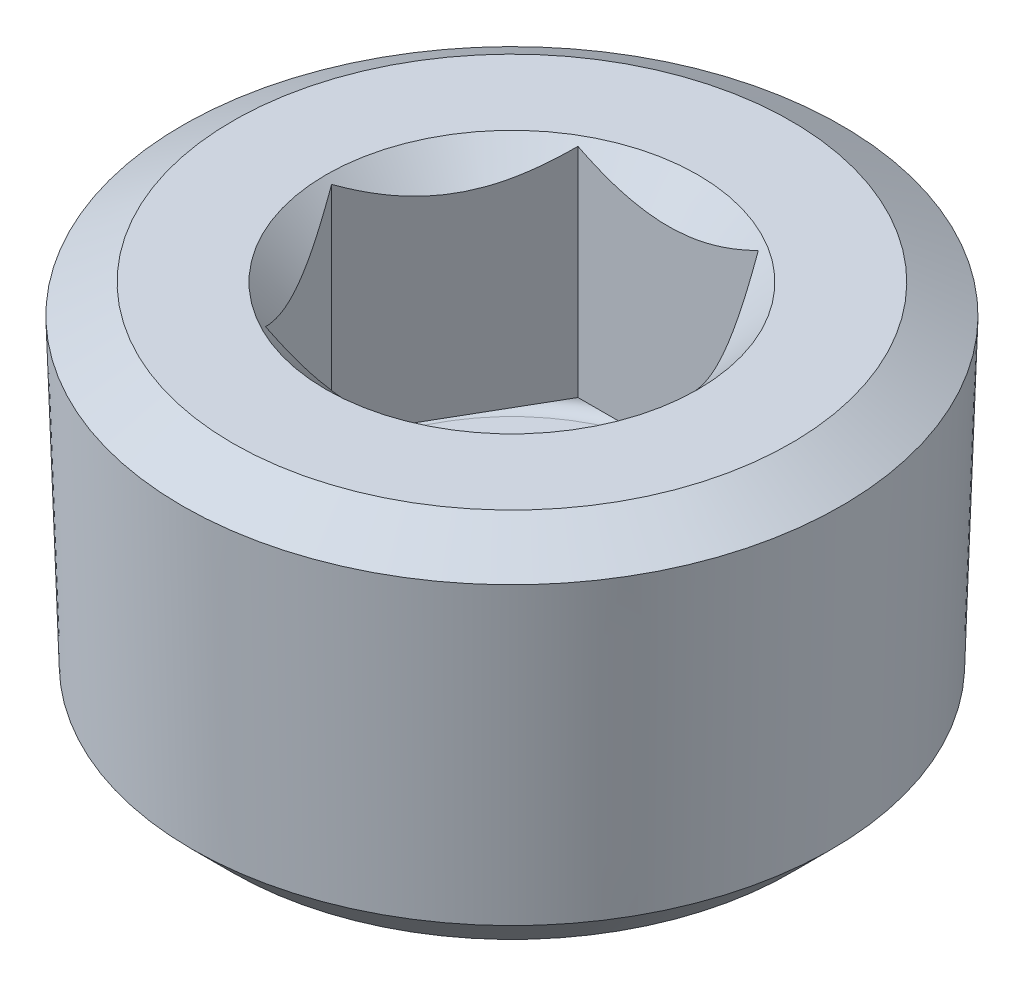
ISO-10303-21;
HEADER;
FILE_DESCRIPTION(('STEP AP214'),'2;1');
FILE_NAME('part.step','',(''),(''),'','','');
FILE_SCHEMA(('AUTOMOTIVE_DESIGN { 1 0 10303 214 1 1 1 1 }'));
ENDSEC;
DATA;
#1=APPLICATION_CONTEXT('core data for automotive mechanical design processes');
#2=APPLICATION_PROTOCOL_DEFINITION('international standard','automotive_design',2000,#1);
#3=PRODUCT_CONTEXT('',#1,'mechanical');
#4=PRODUCT('Part','Part','',(#3));
#5=PRODUCT_RELATED_PRODUCT_CATEGORY('part','',(#4));
#6=PRODUCT_DEFINITION_FORMATION('','',#4);
#7=PRODUCT_DEFINITION_CONTEXT('part definition',#1,'design');
#8=PRODUCT_DEFINITION('design','',#6,#7);
#9=PRODUCT_DEFINITION_SHAPE('','',#8);
#10=(LENGTH_UNIT() NAMED_UNIT(*) SI_UNIT(.MILLI.,.METRE.));
#11=(NAMED_UNIT(*) PLANE_ANGLE_UNIT() SI_UNIT($,.RADIAN.));
#12=(NAMED_UNIT(*) SI_UNIT($,.STERADIAN.) SOLID_ANGLE_UNIT());
#13=UNCERTAINTY_MEASURE_WITH_UNIT(LENGTH_MEASURE(1.E-05),#10,'distance_accuracy_value','');
#14=(GEOMETRIC_REPRESENTATION_CONTEXT(3) GLOBAL_UNCERTAINTY_ASSIGNED_CONTEXT((#13)) GLOBAL_UNIT_ASSIGNED_CONTEXT((#10,
#11,#12)) REPRESENTATION_CONTEXT('',''));
#15=CARTESIAN_POINT('',(0.,0.,0.));
#16=DIRECTION('',(0.,0.,1.));
#17=DIRECTION('',(1.,0.,0.));
#18=AXIS2_PLACEMENT_3D('',#15,#16,#17);
#19=CARTESIAN_POINT('',(0.,0.,0.));
#20=DIRECTION('',(0.,1.,0.));
#21=DIRECTION('',(0.,0.,1.));
#22=AXIS2_PLACEMENT_3D('',#19,#20,#21);
#23=PLANE('',#22);
#24=CARTESIAN_POINT('',(0.,0.,0.));
#25=DIRECTION('',(0.,1.,0.));
#26=DIRECTION('',(0.,0.,1.));
#27=AXIS2_PLACEMENT_3D('',#24,#25,#26);
#28=CIRCLE('',#27,9.525);
#29=CARTESIAN_POINT('',(0.,0.,9.525));
#30=VERTEX_POINT('',#29);
#31=EDGE_CURVE('E210',#30,#30,#28,.T.);
#32=ORIENTED_EDGE('',*,*,#31,.F.);
#33=EDGE_LOOP('',(#32));
#34=FACE_BOUND('',#33,.T.);
#35=CARTESIAN_POINT('',(0.,0.,0.));
#36=DIRECTION('',(0.,1.,0.));
#37=DIRECTION('',(0.,0.,1.));
#38=AXIS2_PLACEMENT_3D('',#35,#36,#37);
#39=CIRCLE('',#38,14.3024233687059);
#40=CARTESIAN_POINT('',(0.,0.,14.3024233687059));
#41=VERTEX_POINT('',#40);
#42=EDGE_CURVE('E96',#41,#41,#39,.T.);
#43=ORIENTED_EDGE('',*,*,#42,.T.);
#44=EDGE_LOOP('',(#43));
#45=FACE_BOUND('',#44,.T.);
#46=ADVANCED_FACE('F34',(#34,#45),#23,.T.);
#47=CARTESIAN_POINT('',(0.,0.,0.));
#48=DIRECTION('',(0.,-1.,0.));
#49=DIRECTION('',(0.,0.,-1.));
#50=AXIS2_PLACEMENT_3D('',#47,#48,#49);
#51=CONICAL_SURFACE('',#50,14.3024233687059,1.0471975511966);
#52=CARTESIAN_POINT('',(0.,-1.48966435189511,0.));
#53=DIRECTION('',(0.,1.,0.));
#54=DIRECTION('',(0.,0.,1.));
#55=AXIS2_PLACEMENT_3D('',#52,#53,#54);
#56=CIRCLE('',#55,16.8825977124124);
#57=CARTESIAN_POINT('',(0.,-1.48966435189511,16.8825977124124));
#58=VERTEX_POINT('',#57);
#59=EDGE_CURVE('E214',#58,#58,#56,.T.);
#60=ORIENTED_EDGE('',*,*,#59,.T.);
#61=EDGE_LOOP('',(#60));
#62=FACE_BOUND('',#61,.T.);
#63=ORIENTED_EDGE('',*,*,#42,.F.);
#64=EDGE_LOOP('',(#63));
#65=FACE_BOUND('',#64,.T.);
#66=ADVANCED_FACE('F200',(#62,#65),#51,.T.);
#67=CARTESIAN_POINT('',(0.,-1.48966435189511,0.));
#68=DIRECTION('',(0.,1.,0.));
#69=DIRECTION('',(0.,0.,1.));
#70=AXIS2_PLACEMENT_3D('',#67,#68,#69);
#71=CONICAL_SURFACE('',#70,16.8825977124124,0.0312064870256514);
#72=CARTESIAN_POINT('',(0.,-16.9525238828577,0.));
#73=DIRECTION('',(0.,1.,0.));
#74=DIRECTION('',(0.,0.,1.));
#75=AXIS2_PLACEMENT_3D('',#72,#73,#74);
#76=CIRCLE('',#75,16.3998994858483);
#77=CARTESIAN_POINT('',(0.,-16.9525238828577,16.3998994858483));
#78=VERTEX_POINT('',#77);
#79=EDGE_CURVE('E217',#78,#78,#76,.T.);
#80=ORIENTED_EDGE('',*,*,#79,.T.);
#81=EDGE_LOOP('',(#80));
#82=FACE_BOUND('',#81,.T.);
#83=ORIENTED_EDGE('',*,*,#59,.F.);
#84=EDGE_LOOP('',(#83));
#85=FACE_BOUND('',#84,.T.);
#86=ADVANCED_FACE('F205',(#82,#85),#71,.T.);
#87=CARTESIAN_POINT('',(0.,-16.9525238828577,0.));
#88=DIRECTION('',(0.,1.,0.));
#89=DIRECTION('',(0.,0.,1.));
#90=AXIS2_PLACEMENT_3D('',#87,#88,#89);
#91=CONICAL_SURFACE('',#90,16.3998994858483,0.785398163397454);
#92=CARTESIAN_POINT('',(0.,-19.05,0.));
#93=DIRECTION('',(0.,1.,0.));
#94=DIRECTION('',(0.,0.,1.));
#95=AXIS2_PLACEMENT_3D('',#92,#93,#94);
#96=CIRCLE('',#95,14.3024233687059);
#97=CARTESIAN_POINT('',(0.,-19.05,14.3024233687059));
#98=VERTEX_POINT('',#97);
#99=EDGE_CURVE('E222',#98,#98,#96,.T.);
#100=ORIENTED_EDGE('',*,*,#99,.T.);
#101=EDGE_LOOP('',(#100));
#102=FACE_BOUND('',#101,.T.);
#103=ORIENTED_EDGE('',*,*,#79,.F.);
#104=EDGE_LOOP('',(#103));
#105=FACE_BOUND('',#104,.T.);
#106=ADVANCED_FACE('F305',(#102,#105),#91,.T.);
#107=CARTESIAN_POINT('',(-14.3024233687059,-19.05,0.));
#108=DIRECTION('',(0.,-1.,0.));
#109=DIRECTION('',(0.,0.,-1.));
#110=AXIS2_PLACEMENT_3D('',#107,#108,#109);
#111=PLANE('',#110);
#112=ORIENTED_EDGE('',*,*,#99,.F.);
#113=EDGE_LOOP('',(#112));
#114=FACE_BOUND('',#113,.T.);
#115=ADVANCED_FACE('F149',(#114),#111,.T.);
#116=CARTESIAN_POINT('',(0.,0.,0.));
#117=DIRECTION('',(0.,1.,0.));
#118=DIRECTION('',(0.,0.,1.));
#119=AXIS2_PLACEMENT_3D('',#116,#117,#118);
#120=CONICAL_SURFACE('',#119,9.525,0.785398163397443);
#121=CARTESIAN_POINT('',(-9.75620633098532,3.09243091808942,8.001));
#122=CARTESIAN_POINT('',(-9.52094099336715,2.91055682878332,8.001));
#123=CARTESIAN_POINT('',(-9.28442126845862,2.73028010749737,8.001));
#124=CARTESIAN_POINT('',(-8.80835565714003,2.37365499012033,8.001));
#125=CARTESIAN_POINT('',(-8.56880907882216,2.19730751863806,8.001));
#126=CARTESIAN_POINT('',(-8.0844234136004,1.8480200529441,8.001));
#127=CARTESIAN_POINT('',(-7.83955777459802,1.67511676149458,8.001));
#128=CARTESIAN_POINT('',(-7.34577433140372,1.33521676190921,8.001));
#129=CARTESIAN_POINT('',(-7.0968568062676,1.16821964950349,8.001));
#130=CARTESIAN_POINT('',(-6.57791291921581,0.830846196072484,8.001));
#131=CARTESIAN_POINT('',(-6.30756757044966,0.660958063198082,8.001));
#132=CARTESIAN_POINT('',(-5.76052121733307,0.331566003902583,8.001));
#133=CARTESIAN_POINT('',(-5.4838191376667,0.172063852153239,8.001));
#134=CARTESIAN_POINT('',(-4.92395672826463,-0.133171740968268,8.001));
#135=CARTESIAN_POINT('',(-4.64081858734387,-0.278945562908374,8.001));
#136=CARTESIAN_POINT('',(-4.06646640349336,-0.553458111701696,8.001));
#137=CARTESIAN_POINT('',(-3.77525629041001,-0.682204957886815,8.001));
#138=CARTESIAN_POINT('',(-3.21459014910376,-0.905803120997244,8.001));
#139=CARTESIAN_POINT('',(-2.94599103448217,-1.00278136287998,8.001));
#140=CARTESIAN_POINT('',(-2.40185059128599,-1.17524738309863,8.001));
#141=CARTESIAN_POINT('',(-2.12630883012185,-1.25073381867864,8.001));
#142=CARTESIAN_POINT('',(-1.57478797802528,-1.37483041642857,8.001));
#143=CARTESIAN_POINT('',(-1.29892235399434,-1.42393631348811,8.001));
#144=CARTESIAN_POINT('',(-0.743636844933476,-1.49423018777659,8.001));
#145=CARTESIAN_POINT('',(-0.46421774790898,-1.51542424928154,8.001));
#146=CARTESIAN_POINT('',(0.0824654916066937,-1.52802781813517,8.001));
#147=CARTESIAN_POINT('',(0.349699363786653,-1.5207587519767,8.001));
#148=CARTESIAN_POINT('',(0.88213316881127,-1.47989810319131,8.001));
#149=CARTESIAN_POINT('',(1.14733291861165,-1.44630417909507,8.001));
#150=CARTESIAN_POINT('',(1.67827793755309,-1.35414026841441,8.001));
#151=CARTESIAN_POINT('',(1.94394456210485,-1.29512495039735,8.001));
#152=CARTESIAN_POINT('',(2.46940811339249,-1.15542669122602,8.001));
#153=CARTESIAN_POINT('',(2.72920532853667,-1.07474481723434,8.001));
#154=CARTESIAN_POINT('',(3.25501235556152,-0.890913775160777,8.001));
#155=CARTESIAN_POINT('',(3.52070069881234,-0.786855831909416,8.001));
#156=CARTESIAN_POINT('',(4.04525678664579,-0.562643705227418,8.001));
#157=CARTESIAN_POINT('',(4.30412141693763,-0.442482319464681,8.001));
#158=CARTESIAN_POINT('',(4.81624343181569,-0.188911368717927,8.001));
#159=CARTESIAN_POINT('',(5.06948054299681,-0.0554611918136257,8.001));
#160=CARTESIAN_POINT('',(5.57015704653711,0.221753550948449,8.001));
#161=CARTESIAN_POINT('',(5.81759731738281,0.365516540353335,8.001));
#162=CARTESIAN_POINT('',(6.29535628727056,0.654051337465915,8.001));
#163=CARTESIAN_POINT('',(6.52591752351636,0.798423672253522,8.001));
#164=CARTESIAN_POINT('',(6.98307831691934,1.09332822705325,8.001));
#165=CARTESIAN_POINT('',(7.20967757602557,1.24386090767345,8.001));
#166=CARTESIAN_POINT('',(7.65761461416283,1.5487666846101,8.001));
#167=CARTESIAN_POINT('',(7.87897999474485,1.7030993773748,8.001));
#168=CARTESIAN_POINT('',(8.31867170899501,2.01591299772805,8.001));
#169=CARTESIAN_POINT('',(8.53699886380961,2.17439276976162,8.001));
#170=CARTESIAN_POINT('',(8.75405107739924,2.33457045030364,8.001));
#171=B_SPLINE_CURVE_WITH_KNOTS('',3,(#121,#122,#123,#124,#125,#126,#127,#128,#129,#130,#131,
#132,#133,#134,#135,#136,#137,#138,#139,#140,#141,#142,#143,#144,#145,#146,#147,#148,#149,#150,
#151,#152,#153,#154,#155,#156,#157,#158,#159,#160,#161,#162,#163,#164,#165,#166,#167,#168,#169,
#170),.UNSPECIFIED.,.F.,.F.,(4,2,2,2,2,2,2,2,2,2,2,2,2,2,2,2,2,2,2,2,2,2,2,2,4),(0.,
0.892121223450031,1.784450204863,2.68365151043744,3.58279114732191,4.54048731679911,
5.4983467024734,6.45329436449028,7.40778500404,8.26376032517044,9.11978911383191,
9.95911277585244,10.7982534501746,11.5989086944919,12.3996351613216,13.2149987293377,
14.030322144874,14.885685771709,15.7414332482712,16.5998812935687,17.4581983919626,
18.274182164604,19.0902270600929,19.8997375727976,20.7090248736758),.UNSPECIFIED.);
#172=CARTESIAN_POINT('',(4.6193795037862,-0.286240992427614,8.001));
#173=VERTEX_POINT('',#172);
#174=CARTESIAN_POINT('',(-4.61937950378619,-0.286240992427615,8.001));
#175=VERTEX_POINT('',#174);
#176=EDGE_CURVE('E48',#173,#175,#171,.F.);
#177=ORIENTED_EDGE('',*,*,#176,.T.);
#178=CARTESIAN_POINT('',(-4.61926403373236,-0.28612552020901,8.0012));
#179=CARTESIAN_POINT('',(-4.69869011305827,-0.365542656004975,7.86362999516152));
#180=CARTESIAN_POINT('',(-4.77872669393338,-0.442522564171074,7.72500257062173));
#181=CARTESIAN_POINT('',(-4.94014062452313,-0.590866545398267,7.44542544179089));
#182=CARTESIAN_POINT('',(-5.02151867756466,-0.662227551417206,7.30447451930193));
#183=CARTESIAN_POINT('',(-5.2686006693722,-0.867378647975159,6.87651595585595));
#184=CARTESIAN_POINT('',(-5.43639624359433,-0.991361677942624,6.58588549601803));
#185=CARTESIAN_POINT('',(-5.77476940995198,-1.20367390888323,5.99980597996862));
#186=CARTESIAN_POINT('',(-5.94526052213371,-1.29253797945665,5.70450671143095));
#187=CARTESIAN_POINT('',(-6.2038000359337,-1.39533175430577,5.25670313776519));
#188=CARTESIAN_POINT('',(-6.29036050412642,-1.42449887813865,5.10677600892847));
#189=CARTESIAN_POINT('',(-6.46421433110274,-1.47200567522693,4.80565234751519));
#190=CARTESIAN_POINT('',(-6.55150757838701,-1.49034696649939,4.65445600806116));
#191=CARTESIAN_POINT('',(-6.7642309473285,-1.52109895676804,4.28600832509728));
#192=CARTESIAN_POINT('',(-6.88989027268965,-1.52755109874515,4.06835998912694));
#193=CARTESIAN_POINT('',(-7.14098242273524,-1.51672016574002,3.63345562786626));
#194=CARTESIAN_POINT('',(-7.26641515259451,-1.49942877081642,3.41619976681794));
#195=CARTESIAN_POINT('',(-7.51609803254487,-1.44213002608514,2.98373633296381));
#196=CARTESIAN_POINT('',(-7.64034670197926,-1.40209727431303,2.76853132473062));
#197=CARTESIAN_POINT('',(-7.88670850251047,-1.30149224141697,2.34182016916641));
#198=CARTESIAN_POINT('',(-8.00882179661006,-1.24092153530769,2.13031373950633));
#199=CARTESIAN_POINT('',(-8.22559130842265,-1.11631110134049,1.75485793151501));
#200=CARTESIAN_POINT('',(-8.32072758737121,-1.05554902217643,1.59007706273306));
#201=CARTESIAN_POINT('',(-8.5092923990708,-0.924233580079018,1.26347322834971));
#202=CARTESIAN_POINT('',(-8.60272088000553,-0.853679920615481,1.10165035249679));
#203=CARTESIAN_POINT('',(-8.78757582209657,-0.704362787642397,0.781472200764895));
#204=CARTESIAN_POINT('',(-8.87900754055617,-0.62562513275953,0.623107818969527));
#205=CARTESIAN_POINT('',(-9.06017798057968,-0.460973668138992,0.309311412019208));
#206=CARTESIAN_POINT('',(-9.14991769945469,-0.375064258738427,0.153877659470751));
#207=CARTESIAN_POINT('',(-9.23887447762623,-0.28612552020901,-0.000199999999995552));
#208=B_SPLINE_CURVE_WITH_KNOTS('',3,(#178,#179,#180,#181,#182,#183,#184,#185,#186,#187,#188,
#189,#190,#191,#192,#193,#194,#195,#196,#197,#198,#199,#200,#201,#202,#203,#204,#205,#206,#207),
.UNSPECIFIED.,.F.,.F.,(4,2,2,2,2,2,2,2,2,2,2,2,2,2,4),(0.,0.532763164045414,1.06581514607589,
2.13767380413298,3.1925129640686,3.71889809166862,4.24520452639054,4.99823705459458,
5.75153351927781,6.5056730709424,7.25975480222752,7.8586907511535,8.45764484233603,
9.05476364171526,9.6515187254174),.UNSPECIFIED.);
#209=CARTESIAN_POINT('',(-9.23875900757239,-0.286240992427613,0.));
#210=VERTEX_POINT('',#209);
#211=EDGE_CURVE('E102',#175,#210,#208,.T.);
#212=ORIENTED_EDGE('',*,*,#211,.T.);
#213=CARTESIAN_POINT('',(-9.23887447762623,-0.28612552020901,0.000200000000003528));
#214=CARTESIAN_POINT('',(-9.15944839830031,-0.365542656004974,-0.137370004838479));
#215=CARTESIAN_POINT('',(-9.0794118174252,-0.442522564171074,-0.275997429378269));
#216=CARTESIAN_POINT('',(-8.91799788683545,-0.590866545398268,-0.555574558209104));
#217=CARTESIAN_POINT('',(-8.83661983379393,-0.662227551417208,-0.696525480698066));
#218=CARTESIAN_POINT('',(-8.58953784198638,-0.867378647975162,-1.12448404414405));
#219=CARTESIAN_POINT('',(-8.42174226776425,-0.991361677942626,-1.41511450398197));
#220=CARTESIAN_POINT('',(-8.0833691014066,-1.20367390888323,-2.00119402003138));
#221=CARTESIAN_POINT('',(-7.91287798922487,-1.29253797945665,-2.29649328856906));
#222=CARTESIAN_POINT('',(-7.65433847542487,-1.39533175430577,-2.74429686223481));
#223=CARTESIAN_POINT('',(-7.56777800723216,-1.42449887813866,-2.89422399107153));
#224=CARTESIAN_POINT('',(-7.39392418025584,-1.47200567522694,-3.19534765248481));
#225=CARTESIAN_POINT('',(-7.30663093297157,-1.4903469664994,-3.34654399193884));
#226=CARTESIAN_POINT('',(-7.09390756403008,-1.52109895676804,-3.71499167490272));
#227=CARTESIAN_POINT('',(-6.96824823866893,-1.52755109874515,-3.93264001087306));
#228=CARTESIAN_POINT('',(-6.71715608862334,-1.51672016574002,-4.36754437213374));
#229=CARTESIAN_POINT('',(-6.59172335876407,-1.49942877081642,-4.58480023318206));
#230=CARTESIAN_POINT('',(-6.34204047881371,-1.44213002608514,-5.01726366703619));
#231=CARTESIAN_POINT('',(-6.21779180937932,-1.40209727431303,-5.23246867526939));
#232=CARTESIAN_POINT('',(-5.97143000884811,-1.30149224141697,-5.6591798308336));
#233=CARTESIAN_POINT('',(-5.84931671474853,-1.24092153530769,-5.87068626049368));
#234=CARTESIAN_POINT('',(-5.63254720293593,-1.11631110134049,-6.246142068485));
#235=CARTESIAN_POINT('',(-5.53741092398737,-1.05554902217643,-6.41092293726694));
#236=CARTESIAN_POINT('',(-5.34884611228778,-0.924233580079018,-6.73752677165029));
#237=CARTESIAN_POINT('',(-5.25541763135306,-0.853679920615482,-6.89934964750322));
#238=CARTESIAN_POINT('',(-5.07056268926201,-0.704362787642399,-7.21952779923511));
#239=CARTESIAN_POINT('',(-4.97913097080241,-0.625625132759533,-7.37789218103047));
#240=CARTESIAN_POINT('',(-4.7979605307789,-0.460973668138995,-7.69168858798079));
#241=CARTESIAN_POINT('',(-4.7082208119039,-0.37506425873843,-7.84712234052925));
#242=CARTESIAN_POINT('',(-4.61926403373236,-0.286125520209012,-8.0012));
#243=B_SPLINE_CURVE_WITH_KNOTS('',3,(#213,#214,#215,#216,#217,#218,#219,#220,#221,#222,#223,
#224,#225,#226,#227,#228,#229,#230,#231,#232,#233,#234,#235,#236,#237,#238,#239,#240,#241,#242),
.UNSPECIFIED.,.F.,.F.,(4,2,2,2,2,2,2,2,2,2,2,2,2,2,4),(0.,0.532763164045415,1.06581514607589,
2.13767380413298,3.19251296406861,3.71889809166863,4.24520452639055,4.99823705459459,
5.75153351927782,6.50567307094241,7.25975480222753,7.85869075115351,8.45764484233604,
9.05476364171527,9.65151872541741),.UNSPECIFIED.);
#244=CARTESIAN_POINT('',(-4.6193795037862,-0.286240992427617,-8.00099999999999));
#245=VERTEX_POINT('',#244);
#246=EDGE_CURVE('E172',#210,#245,#243,.T.);
#247=ORIENTED_EDGE('',*,*,#246,.T.);
#248=CARTESIAN_POINT('',(-9.75620633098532,3.09243091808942,-8.00099999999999));
#249=CARTESIAN_POINT('',(-9.52094099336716,2.91055682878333,-8.00099999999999));
#250=CARTESIAN_POINT('',(-9.28442126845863,2.73028010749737,-8.00099999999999));
#251=CARTESIAN_POINT('',(-8.80835565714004,2.37365499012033,-8.00099999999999));
#252=CARTESIAN_POINT('',(-8.56880907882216,2.19730751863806,-8.00099999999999));
#253=CARTESIAN_POINT('',(-8.08442341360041,1.8480200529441,-8.00099999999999));
#254=CARTESIAN_POINT('',(-7.83955777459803,1.67511676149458,-8.00099999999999));
#255=CARTESIAN_POINT('',(-7.34577433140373,1.33521676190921,-8.00099999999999));
#256=CARTESIAN_POINT('',(-7.0968568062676,1.16821964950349,-8.00099999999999));
#257=CARTESIAN_POINT('',(-6.57791291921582,0.830846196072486,-8.00099999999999));
#258=CARTESIAN_POINT('',(-6.30756757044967,0.660958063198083,-8.00099999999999));
#259=CARTESIAN_POINT('',(-5.76052121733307,0.331566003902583,-8.00099999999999));
#260=CARTESIAN_POINT('',(-5.4838191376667,0.172063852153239,-8.00099999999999));
#261=CARTESIAN_POINT('',(-4.92395672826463,-0.133171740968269,-8.00099999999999));
#262=CARTESIAN_POINT('',(-4.64081858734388,-0.278945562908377,-8.00099999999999));
#263=CARTESIAN_POINT('',(-4.06646640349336,-0.5534581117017,-8.00099999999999));
#264=CARTESIAN_POINT('',(-3.77525629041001,-0.682204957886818,-8.00099999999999));
#265=CARTESIAN_POINT('',(-3.21459014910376,-0.905803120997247,-8.00099999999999));
#266=CARTESIAN_POINT('',(-2.94599103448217,-1.00278136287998,-8.00099999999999));
#267=CARTESIAN_POINT('',(-2.40185059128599,-1.17524738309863,-8.00099999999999));
#268=CARTESIAN_POINT('',(-2.12630883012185,-1.25073381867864,-8.00099999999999));
#269=CARTESIAN_POINT('',(-1.57478797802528,-1.37483041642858,-8.00099999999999));
#270=CARTESIAN_POINT('',(-1.29892235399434,-1.42393631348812,-8.00099999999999));
#271=CARTESIAN_POINT('',(-0.743636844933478,-1.49423018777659,-8.00099999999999));
#272=CARTESIAN_POINT('',(-0.464217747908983,-1.51542424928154,-8.00099999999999));
#273=CARTESIAN_POINT('',(0.0824654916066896,-1.52802781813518,-8.00099999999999));
#274=CARTESIAN_POINT('',(0.349699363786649,-1.5207587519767,-8.00099999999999));
#275=CARTESIAN_POINT('',(0.882133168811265,-1.47989810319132,-8.00099999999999));
#276=CARTESIAN_POINT('',(1.14733291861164,-1.44630417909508,-8.00099999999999));
#277=CARTESIAN_POINT('',(1.67827793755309,-1.35414026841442,-8.00099999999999));
#278=CARTESIAN_POINT('',(1.94394456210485,-1.29512495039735,-8.00099999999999));
#279=CARTESIAN_POINT('',(2.46940811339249,-1.15542669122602,-8.00099999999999));
#280=CARTESIAN_POINT('',(2.72920532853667,-1.07474481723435,-8.00099999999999));
#281=CARTESIAN_POINT('',(3.25501235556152,-0.89091377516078,-8.00099999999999));
#282=CARTESIAN_POINT('',(3.52070069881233,-0.78685583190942,-8.00099999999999));
#283=CARTESIAN_POINT('',(4.04525678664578,-0.562643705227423,-8.00099999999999));
#284=CARTESIAN_POINT('',(4.30412141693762,-0.442482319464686,-8.00099999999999));
#285=CARTESIAN_POINT('',(4.81624343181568,-0.188911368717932,-8.00099999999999));
#286=CARTESIAN_POINT('',(5.06948054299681,-0.0554611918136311,-8.00099999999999));
#287=CARTESIAN_POINT('',(5.5701570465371,0.221753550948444,-8.00099999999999));
#288=CARTESIAN_POINT('',(5.81759731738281,0.365516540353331,-8.00099999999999));
#289=CARTESIAN_POINT('',(6.29535628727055,0.654051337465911,-8.00099999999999));
#290=CARTESIAN_POINT('',(6.52591752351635,0.798423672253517,-8.00099999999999));
#291=CARTESIAN_POINT('',(6.98307831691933,1.09332822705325,-8.00099999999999));
#292=CARTESIAN_POINT('',(7.20967757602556,1.24386090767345,-8.00099999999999));
#293=CARTESIAN_POINT('',(7.65761461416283,1.5487666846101,-8.00099999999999));
#294=CARTESIAN_POINT('',(7.87897999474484,1.70309937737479,-8.00099999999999));
#295=CARTESIAN_POINT('',(8.31867170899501,2.01591299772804,-8.00099999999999));
#296=CARTESIAN_POINT('',(8.5369988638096,2.17439276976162,-8.00099999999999));
#297=CARTESIAN_POINT('',(8.75405107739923,2.33457045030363,-8.00099999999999));
#298=B_SPLINE_CURVE_WITH_KNOTS('',3,(#248,#249,#250,#251,#252,#253,#254,#255,#256,#257,#258,
#259,#260,#261,#262,#263,#264,#265,#266,#267,#268,#269,#270,#271,#272,#273,#274,#275,#276,#277,
#278,#279,#280,#281,#282,#283,#284,#285,#286,#287,#288,#289,#290,#291,#292,#293,#294,#295,#296,
#297),.UNSPECIFIED.,.F.,.F.,(4,2,2,2,2,2,2,2,2,2,2,2,2,2,2,2,2,2,2,2,2,2,2,2,4),(0.,
0.892121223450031,1.784450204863,2.68365151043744,3.58279114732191,4.54048731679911,
5.49834670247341,6.45329436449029,7.40778500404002,8.26376032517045,9.11978911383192,
9.95911277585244,10.7982534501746,11.5989086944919,12.3996351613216,13.2149987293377,
14.030322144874,14.885685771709,15.7414332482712,16.5998812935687,17.4581983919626,
18.274182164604,19.0902270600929,19.8997375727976,20.7090248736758),.UNSPECIFIED.);
#299=CARTESIAN_POINT('',(4.61937950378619,-0.286240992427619,-8.00099999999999));
#300=VERTEX_POINT('',#299);
#301=EDGE_CURVE('E165',#245,#300,#298,.T.);
#302=ORIENTED_EDGE('',*,*,#301,.T.);
#303=CARTESIAN_POINT('',(4.61926403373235,-0.286125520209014,-8.0012));
#304=CARTESIAN_POINT('',(4.69869011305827,-0.365542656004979,-7.86362999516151));
#305=CARTESIAN_POINT('',(4.77872669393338,-0.442522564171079,-7.72500257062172));
#306=CARTESIAN_POINT('',(4.94014062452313,-0.590866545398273,-7.44542544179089));
#307=CARTESIAN_POINT('',(5.02151867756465,-0.662227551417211,-7.30447451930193));
#308=CARTESIAN_POINT('',(5.2686006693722,-0.867378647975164,-6.87651595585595));
#309=CARTESIAN_POINT('',(5.43639624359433,-0.991361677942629,-6.58588549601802));
#310=CARTESIAN_POINT('',(5.77476940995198,-1.20367390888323,-5.99980597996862));
#311=CARTESIAN_POINT('',(5.9452605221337,-1.29253797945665,-5.70450671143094));
#312=CARTESIAN_POINT('',(6.2038000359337,-1.39533175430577,-5.25670313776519));
#313=CARTESIAN_POINT('',(6.29036050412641,-1.42449887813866,-5.10677600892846));
#314=CARTESIAN_POINT('',(6.46421433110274,-1.47200567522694,-4.80565234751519));
#315=CARTESIAN_POINT('',(6.551507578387,-1.4903469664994,-4.65445600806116));
#316=CARTESIAN_POINT('',(6.76423094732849,-1.52109895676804,-4.28600832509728));
#317=CARTESIAN_POINT('',(6.88989027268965,-1.52755109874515,-4.06835998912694));
#318=CARTESIAN_POINT('',(7.14098242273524,-1.51672016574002,-3.63345562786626));
#319=CARTESIAN_POINT('',(7.26641515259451,-1.49942877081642,-3.41619976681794));
#320=CARTESIAN_POINT('',(7.51609803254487,-1.44213002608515,-2.98373633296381));
#321=CARTESIAN_POINT('',(7.64034670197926,-1.40209727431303,-2.76853132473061));
#322=CARTESIAN_POINT('',(7.88670850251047,-1.30149224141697,-2.3418201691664));
#323=CARTESIAN_POINT('',(8.00882179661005,-1.24092153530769,-2.13031373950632));
#324=CARTESIAN_POINT('',(8.22559130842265,-1.11631110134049,-1.75485793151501));
#325=CARTESIAN_POINT('',(8.32072758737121,-1.05554902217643,-1.59007706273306));
#326=CARTESIAN_POINT('',(8.5092923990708,-0.92423358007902,-1.26347322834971));
#327=CARTESIAN_POINT('',(8.60272088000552,-0.853679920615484,-1.10165035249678));
#328=CARTESIAN_POINT('',(8.78757582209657,-0.704362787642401,-0.781472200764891));
#329=CARTESIAN_POINT('',(8.87900754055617,-0.625625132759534,-0.623107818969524));
#330=CARTESIAN_POINT('',(9.06017798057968,-0.460973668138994,-0.309311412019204));
#331=CARTESIAN_POINT('',(9.14991769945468,-0.375064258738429,-0.153877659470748));
#332=CARTESIAN_POINT('',(9.23887447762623,-0.28612552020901,0.000199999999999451));
#333=B_SPLINE_CURVE_WITH_KNOTS('',3,(#303,#304,#305,#306,#307,#308,#309,#310,#311,#312,#313,
#314,#315,#316,#317,#318,#319,#320,#321,#322,#323,#324,#325,#326,#327,#328,#329,#330,#331,#332),
.UNSPECIFIED.,.F.,.F.,(4,2,2,2,2,2,2,2,2,2,2,2,2,2,4),(0.,0.532763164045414,1.06581514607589,
2.13767380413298,3.19251296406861,3.71889809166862,4.24520452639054,4.99823705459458,
5.75153351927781,6.5056730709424,7.25975480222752,7.8586907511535,8.45764484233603,
9.05476364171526,9.6515187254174),.UNSPECIFIED.);
#334=CARTESIAN_POINT('',(9.23875900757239,-0.286240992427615,0.));
#335=VERTEX_POINT('',#334);
#336=EDGE_CURVE('E158',#300,#335,#333,.T.);
#337=ORIENTED_EDGE('',*,*,#336,.T.);
#338=CARTESIAN_POINT('',(9.23887447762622,-0.286125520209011,-0.000200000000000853));
#339=CARTESIAN_POINT('',(9.15944839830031,-0.365542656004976,0.137370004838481));
#340=CARTESIAN_POINT('',(9.0794118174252,-0.442522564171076,0.275997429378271));
#341=CARTESIAN_POINT('',(8.91799788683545,-0.59086654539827,0.555574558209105));
#342=CARTESIAN_POINT('',(8.83661983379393,-0.662227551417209,0.696525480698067));
#343=CARTESIAN_POINT('',(8.58953784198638,-0.867378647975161,1.12448404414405));
#344=CARTESIAN_POINT('',(8.42174226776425,-0.991361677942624,1.41511450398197));
#345=CARTESIAN_POINT('',(8.0833691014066,-1.20367390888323,2.00119402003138));
#346=CARTESIAN_POINT('',(7.91287798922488,-1.29253797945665,2.29649328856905));
#347=CARTESIAN_POINT('',(7.65433847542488,-1.39533175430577,2.7442968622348));
#348=CARTESIAN_POINT('',(7.56777800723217,-1.42449887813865,2.89422399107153));
#349=CARTESIAN_POINT('',(7.39392418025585,-1.47200567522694,3.19534765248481));
#350=CARTESIAN_POINT('',(7.30663093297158,-1.49034696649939,3.34654399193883));
#351=CARTESIAN_POINT('',(7.09390756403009,-1.52109895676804,3.71499167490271));
#352=CARTESIAN_POINT('',(6.96824823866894,-1.52755109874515,3.93264001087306));
#353=CARTESIAN_POINT('',(6.71715608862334,-1.51672016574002,4.36754437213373));
#354=CARTESIAN_POINT('',(6.59172335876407,-1.49942877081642,4.58480023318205));
#355=CARTESIAN_POINT('',(6.34204047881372,-1.44213002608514,5.01726366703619));
#356=CARTESIAN_POINT('',(6.21779180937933,-1.40209727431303,5.23246867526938));
#357=CARTESIAN_POINT('',(5.97143000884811,-1.30149224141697,5.65917983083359));
#358=CARTESIAN_POINT('',(5.84931671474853,-1.24092153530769,5.87068626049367));
#359=CARTESIAN_POINT('',(5.63254720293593,-1.11631110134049,6.24614206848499));
#360=CARTESIAN_POINT('',(5.53741092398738,-1.05554902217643,6.41092293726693));
#361=CARTESIAN_POINT('',(5.34884611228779,-0.924233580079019,6.73752677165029));
#362=CARTESIAN_POINT('',(5.25541763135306,-0.853679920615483,6.89934964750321));
#363=CARTESIAN_POINT('',(5.07056268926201,-0.704362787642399,7.21952779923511));
#364=CARTESIAN_POINT('',(4.97913097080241,-0.625625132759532,7.37789218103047));
#365=CARTESIAN_POINT('',(4.79796053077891,-0.460973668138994,7.69168858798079));
#366=CARTESIAN_POINT('',(4.7082208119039,-0.375064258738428,7.84712234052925));
#367=CARTESIAN_POINT('',(4.61926403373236,-0.28612552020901,8.0012));
#368=B_SPLINE_CURVE_WITH_KNOTS('',3,(#338,#339,#340,#341,#342,#343,#344,#345,#346,#347,#348,
#349,#350,#351,#352,#353,#354,#355,#356,#357,#358,#359,#360,#361,#362,#363,#364,#365,#366,#367),
.UNSPECIFIED.,.F.,.F.,(4,2,2,2,2,2,2,2,2,2,2,2,2,2,4),(0.,0.532763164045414,1.06581514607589,
2.13767380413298,3.1925129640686,3.71889809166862,4.24520452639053,4.99823705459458,
5.75153351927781,6.5056730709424,7.25975480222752,7.8586907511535,8.45764484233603,
9.05476364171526,9.65151872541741),.UNSPECIFIED.);
#369=EDGE_CURVE('E121',#335,#173,#368,.T.);
#370=ORIENTED_EDGE('',*,*,#369,.T.);
#371=EDGE_LOOP('',(#177,#212,#247,#302,#337,#370));
#372=FACE_BOUND('',#371,.T.);
#373=ORIENTED_EDGE('',*,*,#31,.T.);
#374=EDGE_LOOP('',(#373));
#375=FACE_BOUND('',#374,.T.);
#376=ADVANCED_FACE('F144',(#372,#375),#120,.F.);
#377=CARTESIAN_POINT('',(-9.23875900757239,-11.43,0.));
#378=DIRECTION('',(-0.866025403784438,0.,0.5));
#379=DIRECTION('',(0.5,0.,0.866025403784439));
#380=AXIS2_PLACEMENT_3D('',#377,#378,#379);
#381=PLANE('',#380);
#382=DIRECTION('',(0.,1.,0.));
#383=VECTOR('',#382,1.);
#384=CARTESIAN_POINT('',(-4.61937950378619,-11.43,8.001));
#385=LINE('',#384,#383);
#386=CARTESIAN_POINT('',(-4.61937950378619,-11.43,8.001));
#387=VERTEX_POINT('',#386);
#388=EDGE_CURVE('E90',#387,#175,#385,.T.);
#389=ORIENTED_EDGE('',*,*,#388,.F.);
#390=DIRECTION('',(0.5,0.,0.866025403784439));
#391=VECTOR('',#390,1.);
#392=CARTESIAN_POINT('',(-8.92931925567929,-11.43,0.535965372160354));
#393=LINE('',#392,#391);
#394=CARTESIAN_POINT('',(-9.23875900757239,-11.43,0.));
#395=VERTEX_POINT('',#394);
#396=EDGE_CURVE('E95',#395,#387,#393,.T.);
#397=ORIENTED_EDGE('',*,*,#396,.F.);
#398=DIRECTION('',(0.,1.,0.));
#399=VECTOR('',#398,1.);
#400=CARTESIAN_POINT('',(-9.23875900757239,-11.43,0.));
#401=LINE('',#400,#399);
#402=EDGE_CURVE('E135',#395,#210,#401,.T.);
#403=ORIENTED_EDGE('',*,*,#402,.T.);
#404=ORIENTED_EDGE('',*,*,#211,.F.);
#405=EDGE_LOOP('',(#389,#397,#403,#404));
#406=FACE_BOUND('',#405,.T.);
#407=ADVANCED_FACE('F99',(#406),#381,.F.);
#408=CARTESIAN_POINT('',(-4.6193795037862,-11.43,-8.00099999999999));
#409=DIRECTION('',(-0.866025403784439,0.,-0.5));
#410=DIRECTION('',(-0.5,0.,0.866025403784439));
#411=AXIS2_PLACEMENT_3D('',#408,#409,#410);
#412=PLANE('',#411);
#413=ORIENTED_EDGE('',*,*,#402,.F.);
#414=DIRECTION('',(-0.5,0.,0.866025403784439));
#415=VECTOR('',#414,1.);
#416=CARTESIAN_POINT('',(-8.92931925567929,-11.43,-0.535965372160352));
#417=LINE('',#416,#415);
#418=CARTESIAN_POINT('',(-4.6193795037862,-11.43,-8.00099999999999));
#419=VERTEX_POINT('',#418);
#420=EDGE_CURVE('E107',#419,#395,#417,.T.);
#421=ORIENTED_EDGE('',*,*,#420,.F.);
#422=DIRECTION('',(0.,1.,0.));
#423=VECTOR('',#422,1.);
#424=CARTESIAN_POINT('',(-4.6193795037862,-11.43,-8.00099999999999));
#425=LINE('',#424,#423);
#426=EDGE_CURVE('E123',#419,#245,#425,.T.);
#427=ORIENTED_EDGE('',*,*,#426,.T.);
#428=ORIENTED_EDGE('',*,*,#246,.F.);
#429=EDGE_LOOP('',(#413,#421,#427,#428));
#430=FACE_BOUND('',#429,.T.);
#431=ADVANCED_FACE('F183',(#430),#412,.F.);
#432=CARTESIAN_POINT('',(4.61937950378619,-11.43,-8.00099999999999));
#433=DIRECTION('',(0.,0.,-1.));
#434=DIRECTION('',(-1.,0.,0.));
#435=AXIS2_PLACEMENT_3D('',#432,#433,#434);
#436=PLANE('',#435);
#437=ORIENTED_EDGE('',*,*,#426,.F.);
#438=DIRECTION('',(-1.,0.,0.));
#439=VECTOR('',#438,1.);
#440=CARTESIAN_POINT('',(-8.001,-11.43,-8.00099999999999));
#441=LINE('',#440,#439);
#442=CARTESIAN_POINT('',(4.61937950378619,-11.43,-8.00099999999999));
#443=VERTEX_POINT('',#442);
#444=EDGE_CURVE('E12',#443,#419,#441,.T.);
#445=ORIENTED_EDGE('',*,*,#444,.F.);
#446=DIRECTION('',(0.,1.,0.));
#447=VECTOR('',#446,1.);
#448=CARTESIAN_POINT('',(4.61937950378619,-11.43,-8.00099999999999));
#449=LINE('',#448,#447);
#450=EDGE_CURVE('E118',#443,#300,#449,.T.);
#451=ORIENTED_EDGE('',*,*,#450,.T.);
#452=ORIENTED_EDGE('',*,*,#301,.F.);
#453=EDGE_LOOP('',(#437,#445,#451,#452));
#454=FACE_BOUND('',#453,.T.);
#455=ADVANCED_FACE('F186',(#454),#436,.F.);
#456=CARTESIAN_POINT('',(9.23875900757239,-11.43,0.));
#457=DIRECTION('',(0.866025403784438,0.,-0.5));
#458=DIRECTION('',(-0.5,0.,-0.866025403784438));
#459=AXIS2_PLACEMENT_3D('',#456,#457,#458);
#460=PLANE('',#459);
#461=ORIENTED_EDGE('',*,*,#450,.F.);
#462=DIRECTION('',(-0.5,0.,-0.866025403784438));
#463=VECTOR('',#462,1.);
#464=CARTESIAN_POINT('',(4.92881925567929,-11.43,-7.46503462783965));
#465=LINE('',#464,#463);
#466=CARTESIAN_POINT('',(9.23875900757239,-11.43,0.));
#467=VERTEX_POINT('',#466);
#468=EDGE_CURVE('E41',#467,#443,#465,.T.);
#469=ORIENTED_EDGE('',*,*,#468,.F.);
#470=DIRECTION('',(0.,1.,0.));
#471=VECTOR('',#470,1.);
#472=CARTESIAN_POINT('',(9.23875900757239,-11.43,0.));
#473=LINE('',#472,#471);
#474=EDGE_CURVE('E116',#467,#335,#473,.T.);
#475=ORIENTED_EDGE('',*,*,#474,.T.);
#476=ORIENTED_EDGE('',*,*,#336,.F.);
#477=EDGE_LOOP('',(#461,#469,#475,#476));
#478=FACE_BOUND('',#477,.T.);
#479=ADVANCED_FACE('F114',(#478),#460,.F.);
#480=CARTESIAN_POINT('',(4.6193795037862,-11.43,8.001));
#481=DIRECTION('',(0.866025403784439,0.,0.5));
#482=DIRECTION('',(0.5,0.,-0.866025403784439));
#483=AXIS2_PLACEMENT_3D('',#480,#481,#482);
#484=PLANE('',#483);
#485=ORIENTED_EDGE('',*,*,#474,.F.);
#486=DIRECTION('',(0.5,0.,-0.866025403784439));
#487=VECTOR('',#486,1.);
#488=CARTESIAN_POINT('',(4.92881925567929,-11.43,7.46503462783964));
#489=LINE('',#488,#487);
#490=CARTESIAN_POINT('',(4.6193795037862,-11.43,8.001));
#491=VERTEX_POINT('',#490);
#492=EDGE_CURVE('E56',#491,#467,#489,.T.);
#493=ORIENTED_EDGE('',*,*,#492,.F.);
#494=DIRECTION('',(0.,1.,0.));
#495=VECTOR('',#494,1.);
#496=CARTESIAN_POINT('',(4.6193795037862,-11.43,8.001));
#497=LINE('',#496,#495);
#498=EDGE_CURVE('E92',#491,#173,#497,.T.);
#499=ORIENTED_EDGE('',*,*,#498,.T.);
#500=ORIENTED_EDGE('',*,*,#369,.F.);
#501=EDGE_LOOP('',(#485,#493,#499,#500));
#502=FACE_BOUND('',#501,.T.);
#503=ADVANCED_FACE('F120',(#502),#484,.F.);
#504=CARTESIAN_POINT('',(-4.61937950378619,-11.43,8.001));
#505=DIRECTION('',(0.,0.,1.));
#506=DIRECTION('',(1.,0.,0.));
#507=AXIS2_PLACEMENT_3D('',#504,#505,#506);
#508=PLANE('',#507);
#509=ORIENTED_EDGE('',*,*,#498,.F.);
#510=DIRECTION('',(1.,0.,0.));
#511=VECTOR('',#510,1.);
#512=CARTESIAN_POINT('',(-8.001,-11.43,8.001));
#513=LINE('',#512,#511);
#514=EDGE_CURVE('E87',#387,#491,#513,.T.);
#515=ORIENTED_EDGE('',*,*,#514,.F.);
#516=ORIENTED_EDGE('',*,*,#388,.T.);
#517=ORIENTED_EDGE('',*,*,#176,.F.);
#518=EDGE_LOOP('',(#509,#515,#516,#517));
#519=FACE_BOUND('',#518,.T.);
#520=ADVANCED_FACE('F89',(#519),#508,.F.);
#521=CARTESIAN_POINT('',(-9.525,-12.7,0.));
#522=DIRECTION('',(0.,-1.,0.));
#523=DIRECTION('',(0.,0.,-1.));
#524=AXIS2_PLACEMENT_3D('',#521,#522,#523);
#525=PLANE('',#524);
#526=CARTESIAN_POINT('',(0.,-12.7,0.));
#527=DIRECTION('',(0.,1.,0.));
#528=DIRECTION('',(0.,0.,1.));
#529=AXIS2_PLACEMENT_3D('',#526,#527,#528);
#530=CIRCLE('',#529,9.525);
#531=CARTESIAN_POINT('',(0.,-12.7,9.525));
#532=VERTEX_POINT('',#531);
#533=EDGE_CURVE('E228',#532,#532,#530,.T.);
#534=ORIENTED_EDGE('',*,*,#533,.T.);
#535=EDGE_LOOP('',(#534));
#536=FACE_BOUND('',#535,.T.);
#537=ADVANCED_FACE('F198',(#536),#525,.F.);
#538=CARTESIAN_POINT('',(0.,-12.065,0.));
#539=DIRECTION('',(0.,1.,0.));
#540=DIRECTION('',(0.,0.,1.));
#541=AXIS2_PLACEMENT_3D('',#538,#539,#540);
#542=TOROIDAL_SURFACE('',#541,9.525,0.634999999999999);
#543=ORIENTED_EDGE('',*,*,#533,.F.);
#544=EDGE_LOOP('',(#543));
#545=FACE_BOUND('',#544,.T.);
#546=CARTESIAN_POINT('',(0.,-11.43,0.));
#547=DIRECTION('',(0.,1.,0.));
#548=DIRECTION('',(0.,0.,1.));
#549=AXIS2_PLACEMENT_3D('',#546,#547,#548);
#550=CIRCLE('',#549,9.525);
#551=CARTESIAN_POINT('',(0.,-11.43,9.525));
#552=VERTEX_POINT('',#551);
#553=EDGE_CURVE('E226',#552,#552,#550,.T.);
#554=ORIENTED_EDGE('',*,*,#553,.T.);
#555=EDGE_LOOP('',(#554));
#556=FACE_BOUND('',#555,.T.);
#557=ADVANCED_FACE('F239',(#545,#556),#542,.F.);
#558=CARTESIAN_POINT('',(-8.001,-11.43,0.));
#559=DIRECTION('',(0.,1.,0.));
#560=DIRECTION('',(0.,0.,1.));
#561=AXIS2_PLACEMENT_3D('',#558,#559,#560);
#562=PLANE('',#561);
#563=ORIENTED_EDGE('',*,*,#553,.F.);
#564=EDGE_LOOP('',(#563));
#565=FACE_BOUND('',#564,.T.);
#566=ORIENTED_EDGE('',*,*,#468,.T.);
#567=ORIENTED_EDGE('',*,*,#444,.T.);
#568=ORIENTED_EDGE('',*,*,#420,.T.);
#569=ORIENTED_EDGE('',*,*,#396,.T.);
#570=ORIENTED_EDGE('',*,*,#514,.T.);
#571=ORIENTED_EDGE('',*,*,#492,.T.);
#572=EDGE_LOOP('',(#566,#567,#568,#569,#570,#571));
#573=FACE_BOUND('',#572,.T.);
#574=ADVANCED_FACE('F106',(#565,#573),#562,.F.);
#575=CLOSED_SHELL('',(#46,#66,#86,#106,#115,#376,#407,#431,#455,#479,#503,#520,#537,#557,#574));
#576=MANIFOLD_SOLID_BREP('B2',#575);
#577=ADVANCED_BREP_SHAPE_REPRESENTATION('',(#18,#576),#14);
#578=SHAPE_DEFINITION_REPRESENTATION(#9,#577);
ENDSEC;
END-ISO-10303-21;
